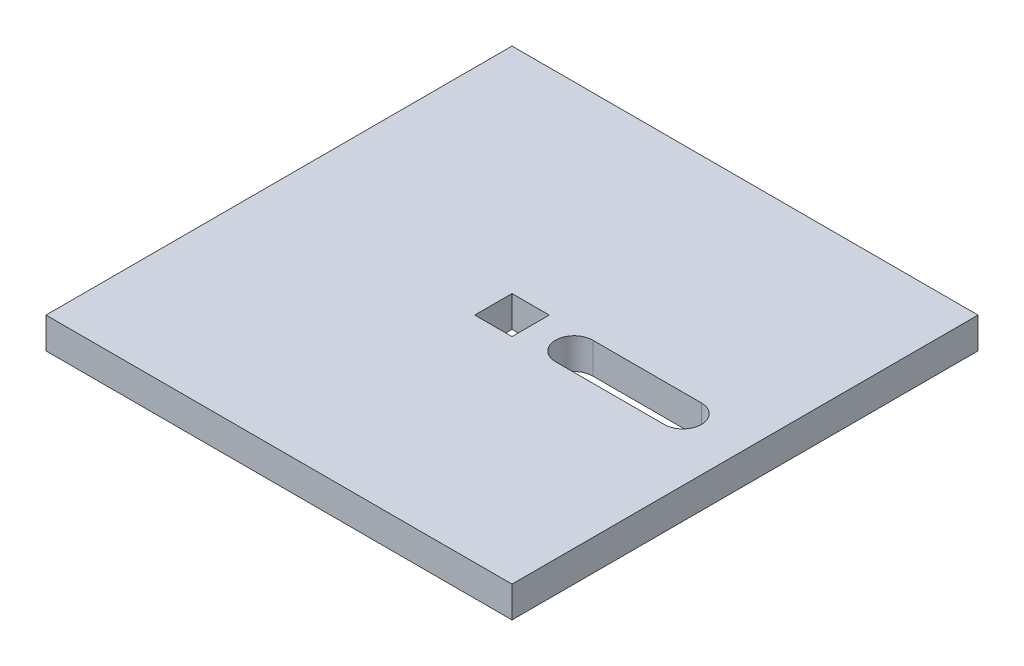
ISO-10303-21;
HEADER;
FILE_DESCRIPTION(('STEP AP214'),'2;1');
FILE_NAME('part.step','',(''),(''),'','','');
FILE_SCHEMA(('AUTOMOTIVE_DESIGN { 1 0 10303 214 1 1 1 1 }'));
ENDSEC;
DATA;
#1=APPLICATION_CONTEXT('core data for automotive mechanical design processes');
#2=APPLICATION_PROTOCOL_DEFINITION('international standard','automotive_design',2000,#1);
#3=PRODUCT_CONTEXT('',#1,'mechanical');
#4=PRODUCT('Part','Part','',(#3));
#5=PRODUCT_RELATED_PRODUCT_CATEGORY('part','',(#4));
#6=PRODUCT_DEFINITION_FORMATION('','',#4);
#7=PRODUCT_DEFINITION_CONTEXT('part definition',#1,'design');
#8=PRODUCT_DEFINITION('design','',#6,#7);
#9=PRODUCT_DEFINITION_SHAPE('','',#8);
#10=(LENGTH_UNIT() NAMED_UNIT(*) SI_UNIT(.MILLI.,.METRE.));
#11=(NAMED_UNIT(*) PLANE_ANGLE_UNIT() SI_UNIT($,.RADIAN.));
#12=(NAMED_UNIT(*) SI_UNIT($,.STERADIAN.) SOLID_ANGLE_UNIT());
#13=UNCERTAINTY_MEASURE_WITH_UNIT(LENGTH_MEASURE(1.E-05),#10,'distance_accuracy_value','');
#14=(GEOMETRIC_REPRESENTATION_CONTEXT(3) GLOBAL_UNCERTAINTY_ASSIGNED_CONTEXT((#13)) GLOBAL_UNIT_ASSIGNED_CONTEXT((#10,
#11,#12)) REPRESENTATION_CONTEXT('',''));
#15=CARTESIAN_POINT('',(0.,0.,0.));
#16=DIRECTION('',(0.,0.,1.));
#17=DIRECTION('',(1.,0.,0.));
#18=AXIS2_PLACEMENT_3D('',#15,#16,#17);
#19=CARTESIAN_POINT('',(75.0000000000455,10.,-75.0000000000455));
#20=DIRECTION('',(-1.,0.,0.));
#21=DIRECTION('',(0.,0.,1.));
#22=AXIS2_PLACEMENT_3D('',#19,#20,#21);
#23=PLANE('',#22);
#24=DIRECTION('',(0.,0.,-1.));
#25=VECTOR('',#24,1.);
#26=CARTESIAN_POINT('',(75.0000000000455,0.,-75.0000000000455));
#27=LINE('',#26,#25);
#28=CARTESIAN_POINT('',(75.0000000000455,0.,75.0000000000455));
#29=VERTEX_POINT('',#28);
#30=CARTESIAN_POINT('',(75.0000000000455,0.,-75.0000000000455));
#31=VERTEX_POINT('',#30);
#32=EDGE_CURVE('E187',#29,#31,#27,.T.);
#33=ORIENTED_EDGE('',*,*,#32,.T.);
#34=DIRECTION('',(0.,-1.,0.));
#35=VECTOR('',#34,1.);
#36=CARTESIAN_POINT('',(75.0000000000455,10.,-75.0000000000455));
#37=LINE('',#36,#35);
#38=CARTESIAN_POINT('',(75.0000000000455,10.,-75.0000000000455));
#39=VERTEX_POINT('',#38);
#40=EDGE_CURVE('E11',#39,#31,#37,.T.);
#41=ORIENTED_EDGE('',*,*,#40,.F.);
#42=DIRECTION('',(0.,0.,-1.));
#43=VECTOR('',#42,1.);
#44=CARTESIAN_POINT('',(75.0000000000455,10.,-75.0000000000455));
#45=LINE('',#44,#43);
#46=CARTESIAN_POINT('',(75.0000000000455,10.,75.0000000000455));
#47=VERTEX_POINT('',#46);
#48=EDGE_CURVE('E197',#47,#39,#45,.T.);
#49=ORIENTED_EDGE('',*,*,#48,.F.);
#50=DIRECTION('',(0.,-1.,0.));
#51=VECTOR('',#50,1.);
#52=CARTESIAN_POINT('',(75.0000000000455,10.,75.0000000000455));
#53=LINE('',#52,#51);
#54=EDGE_CURVE('E206',#47,#29,#53,.T.);
#55=ORIENTED_EDGE('',*,*,#54,.T.);
#56=EDGE_LOOP('',(#33,#41,#49,#55));
#57=FACE_BOUND('',#56,.T.);
#58=ADVANCED_FACE('F39',(#57),#23,.F.);
#59=CARTESIAN_POINT('',(-75.0000000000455,10.,-75.0000000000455));
#60=DIRECTION('',(0.,0.,1.));
#61=DIRECTION('',(1.,0.,0.));
#62=AXIS2_PLACEMENT_3D('',#59,#60,#61);
#63=PLANE('',#62);
#64=DIRECTION('',(-1.,0.,0.));
#65=VECTOR('',#64,1.);
#66=CARTESIAN_POINT('',(-75.0000000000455,0.,-75.0000000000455));
#67=LINE('',#66,#65);
#68=CARTESIAN_POINT('',(-75.0000000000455,0.,-75.0000000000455));
#69=VERTEX_POINT('',#68);
#70=EDGE_CURVE('E207',#31,#69,#67,.T.);
#71=ORIENTED_EDGE('',*,*,#70,.T.);
#72=DIRECTION('',(0.,-1.,0.));
#73=VECTOR('',#72,1.);
#74=CARTESIAN_POINT('',(-75.0000000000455,10.,-75.0000000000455));
#75=LINE('',#74,#73);
#76=CARTESIAN_POINT('',(-75.0000000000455,10.,-75.0000000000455));
#77=VERTEX_POINT('',#76);
#78=EDGE_CURVE('E46',#77,#69,#75,.T.);
#79=ORIENTED_EDGE('',*,*,#78,.F.);
#80=DIRECTION('',(-1.,0.,0.));
#81=VECTOR('',#80,1.);
#82=CARTESIAN_POINT('',(-75.0000000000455,10.,-75.0000000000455));
#83=LINE('',#82,#81);
#84=EDGE_CURVE('E199',#39,#77,#83,.T.);
#85=ORIENTED_EDGE('',*,*,#84,.F.);
#86=ORIENTED_EDGE('',*,*,#40,.T.);
#87=EDGE_LOOP('',(#71,#79,#85,#86));
#88=FACE_BOUND('',#87,.T.);
#89=ADVANCED_FACE('F239',(#88),#63,.F.);
#90=CARTESIAN_POINT('',(-75.0000000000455,10.,-75.0000000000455));
#91=DIRECTION('',(1.,0.,0.));
#92=DIRECTION('',(0.,0.,-1.));
#93=AXIS2_PLACEMENT_3D('',#90,#91,#92);
#94=PLANE('',#93);
#95=DIRECTION('',(0.,0.,1.));
#96=VECTOR('',#95,1.);
#97=CARTESIAN_POINT('',(-75.0000000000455,0.,-75.0000000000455));
#98=LINE('',#97,#96);
#99=CARTESIAN_POINT('',(-75.0000000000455,0.,75.0000000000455));
#100=VERTEX_POINT('',#99);
#101=EDGE_CURVE('E213',#69,#100,#98,.T.);
#102=ORIENTED_EDGE('',*,*,#101,.T.);
#103=DIRECTION('',(0.,-1.,0.));
#104=VECTOR('',#103,1.);
#105=CARTESIAN_POINT('',(-75.0000000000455,10.,75.0000000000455));
#106=LINE('',#105,#104);
#107=CARTESIAN_POINT('',(-75.0000000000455,10.,75.0000000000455));
#108=VERTEX_POINT('',#107);
#109=EDGE_CURVE('E218',#108,#100,#106,.T.);
#110=ORIENTED_EDGE('',*,*,#109,.F.);
#111=DIRECTION('',(0.,0.,1.));
#112=VECTOR('',#111,1.);
#113=CARTESIAN_POINT('',(-75.0000000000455,10.,-75.0000000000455));
#114=LINE('',#113,#112);
#115=EDGE_CURVE('E205',#77,#108,#114,.T.);
#116=ORIENTED_EDGE('',*,*,#115,.F.);
#117=ORIENTED_EDGE('',*,*,#78,.T.);
#118=EDGE_LOOP('',(#102,#110,#116,#117));
#119=FACE_BOUND('',#118,.T.);
#120=ADVANCED_FACE('F223',(#119),#94,.F.);
#121=CARTESIAN_POINT('',(-75.0000000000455,10.,75.0000000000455));
#122=DIRECTION('',(0.,0.,-1.));
#123=DIRECTION('',(-1.,0.,0.));
#124=AXIS2_PLACEMENT_3D('',#121,#122,#123);
#125=PLANE('',#124);
#126=DIRECTION('',(1.,0.,0.));
#127=VECTOR('',#126,1.);
#128=CARTESIAN_POINT('',(-75.0000000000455,0.,75.0000000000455));
#129=LINE('',#128,#127);
#130=EDGE_CURVE('E198',#100,#29,#129,.T.);
#131=ORIENTED_EDGE('',*,*,#130,.T.);
#132=ORIENTED_EDGE('',*,*,#54,.F.);
#133=DIRECTION('',(1.,0.,0.));
#134=VECTOR('',#133,1.);
#135=CARTESIAN_POINT('',(-75.0000000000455,10.,75.0000000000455));
#136=LINE('',#135,#134);
#137=EDGE_CURVE('E204',#108,#47,#136,.T.);
#138=ORIENTED_EDGE('',*,*,#137,.F.);
#139=ORIENTED_EDGE('',*,*,#109,.T.);
#140=EDGE_LOOP('',(#131,#132,#138,#139));
#141=FACE_BOUND('',#140,.T.);
#142=ADVANCED_FACE('F231',(#141),#125,.F.);
#143=CARTESIAN_POINT('',(0.,10.,0.));
#144=DIRECTION('',(0.,1.,0.));
#145=DIRECTION('',(0.,0.,1.));
#146=AXIS2_PLACEMENT_3D('',#143,#144,#145);
#147=PLANE('',#146);
#148=CARTESIAN_POINT('',(20.,10.,0.));
#149=DIRECTION('',(0.,1.,0.));
#150=DIRECTION('',(0.,0.,1.));
#151=AXIS2_PLACEMENT_3D('',#148,#149,#150);
#152=CIRCLE('',#151,6.);
#153=CARTESIAN_POINT('',(20.,10.,-6.));
#154=VERTEX_POINT('',#153);
#155=CARTESIAN_POINT('',(20.,10.,6.));
#156=VERTEX_POINT('',#155);
#157=EDGE_CURVE('E52',#154,#156,#152,.T.);
#158=ORIENTED_EDGE('',*,*,#157,.F.);
#159=DIRECTION('',(-1.,0.,0.));
#160=VECTOR('',#159,1.);
#161=CARTESIAN_POINT('',(20.,10.,-6.));
#162=LINE('',#161,#160);
#163=CARTESIAN_POINT('',(55.,10.,-6.));
#164=VERTEX_POINT('',#163);
#165=EDGE_CURVE('E141',#164,#154,#162,.T.);
#166=ORIENTED_EDGE('',*,*,#165,.F.);
#167=CARTESIAN_POINT('',(55.,10.,0.));
#168=DIRECTION('',(0.,1.,0.));
#169=DIRECTION('',(0.,0.,1.));
#170=AXIS2_PLACEMENT_3D('',#167,#168,#169);
#171=CIRCLE('',#170,6.);
#172=CARTESIAN_POINT('',(55.,10.,6.));
#173=VERTEX_POINT('',#172);
#174=EDGE_CURVE('E148',#173,#164,#171,.T.);
#175=ORIENTED_EDGE('',*,*,#174,.F.);
#176=DIRECTION('',(1.,0.,0.));
#177=VECTOR('',#176,1.);
#178=CARTESIAN_POINT('',(20.,10.,6.));
#179=LINE('',#178,#177);
#180=EDGE_CURVE('E155',#156,#173,#179,.T.);
#181=ORIENTED_EDGE('',*,*,#180,.F.);
#182=EDGE_LOOP('',(#158,#166,#175,#181));
#183=FACE_BOUND('',#182,.T.);
#184=DIRECTION('',(0.,0.,-1.));
#185=VECTOR('',#184,1.);
#186=CARTESIAN_POINT('',(6.,10.,-6.));
#187=LINE('',#186,#185);
#188=CARTESIAN_POINT('',(6.,10.,6.));
#189=VERTEX_POINT('',#188);
#190=CARTESIAN_POINT('',(6.,10.,-6.));
#191=VERTEX_POINT('',#190);
#192=EDGE_CURVE('E157',#189,#191,#187,.T.);
#193=ORIENTED_EDGE('',*,*,#192,.F.);
#194=DIRECTION('',(1.,0.,0.));
#195=VECTOR('',#194,1.);
#196=CARTESIAN_POINT('',(-6.,10.,6.));
#197=LINE('',#196,#195);
#198=CARTESIAN_POINT('',(-6.,10.,6.));
#199=VERTEX_POINT('',#198);
#200=EDGE_CURVE('E168',#199,#189,#197,.T.);
#201=ORIENTED_EDGE('',*,*,#200,.F.);
#202=DIRECTION('',(0.,0.,1.));
#203=VECTOR('',#202,1.);
#204=CARTESIAN_POINT('',(-6.,10.,-6.));
#205=LINE('',#204,#203);
#206=CARTESIAN_POINT('',(-6.,10.,-6.));
#207=VERTEX_POINT('',#206);
#208=EDGE_CURVE('E185',#207,#199,#205,.T.);
#209=ORIENTED_EDGE('',*,*,#208,.F.);
#210=DIRECTION('',(-1.,0.,0.));
#211=VECTOR('',#210,1.);
#212=CARTESIAN_POINT('',(-6.,10.,-6.));
#213=LINE('',#212,#211);
#214=EDGE_CURVE('E176',#191,#207,#213,.T.);
#215=ORIENTED_EDGE('',*,*,#214,.F.);
#216=EDGE_LOOP('',(#193,#201,#209,#215));
#217=FACE_BOUND('',#216,.T.);
#218=ORIENTED_EDGE('',*,*,#48,.T.);
#219=ORIENTED_EDGE('',*,*,#84,.T.);
#220=ORIENTED_EDGE('',*,*,#115,.T.);
#221=ORIENTED_EDGE('',*,*,#137,.T.);
#222=EDGE_LOOP('',(#218,#219,#220,#221));
#223=FACE_BOUND('',#222,.T.);
#224=ADVANCED_FACE('F240',(#183,#217,#223),#147,.T.);
#225=CARTESIAN_POINT('',(0.,0.,0.));
#226=DIRECTION('',(0.,1.,0.));
#227=DIRECTION('',(0.,0.,1.));
#228=AXIS2_PLACEMENT_3D('',#225,#226,#227);
#229=PLANE('',#228);
#230=DIRECTION('',(-1.,0.,0.));
#231=VECTOR('',#230,1.);
#232=CARTESIAN_POINT('',(20.,0.,-6.));
#233=LINE('',#232,#231);
#234=CARTESIAN_POINT('',(55.,0.,-6.));
#235=VERTEX_POINT('',#234);
#236=CARTESIAN_POINT('',(20.,0.,-6.));
#237=VERTEX_POINT('',#236);
#238=EDGE_CURVE('E132',#235,#237,#233,.T.);
#239=ORIENTED_EDGE('',*,*,#238,.T.);
#240=CARTESIAN_POINT('',(20.,0.,0.));
#241=DIRECTION('',(0.,1.,0.));
#242=DIRECTION('',(0.,0.,1.));
#243=AXIS2_PLACEMENT_3D('',#240,#241,#242);
#244=CIRCLE('',#243,6.);
#245=CARTESIAN_POINT('',(20.,0.,6.));
#246=VERTEX_POINT('',#245);
#247=EDGE_CURVE('E127',#237,#246,#244,.T.);
#248=ORIENTED_EDGE('',*,*,#247,.T.);
#249=DIRECTION('',(1.,0.,0.));
#250=VECTOR('',#249,1.);
#251=CARTESIAN_POINT('',(20.,0.,6.));
#252=LINE('',#251,#250);
#253=CARTESIAN_POINT('',(55.,0.,6.));
#254=VERTEX_POINT('',#253);
#255=EDGE_CURVE('E136',#246,#254,#252,.T.);
#256=ORIENTED_EDGE('',*,*,#255,.T.);
#257=CARTESIAN_POINT('',(55.,0.,0.));
#258=DIRECTION('',(0.,1.,0.));
#259=DIRECTION('',(0.,0.,1.));
#260=AXIS2_PLACEMENT_3D('',#257,#258,#259);
#261=CIRCLE('',#260,6.);
#262=EDGE_CURVE('E62',#254,#235,#261,.T.);
#263=ORIENTED_EDGE('',*,*,#262,.T.);
#264=EDGE_LOOP('',(#239,#248,#256,#263));
#265=FACE_BOUND('',#264,.T.);
#266=DIRECTION('',(1.,0.,0.));
#267=VECTOR('',#266,1.);
#268=CARTESIAN_POINT('',(-6.,0.,6.));
#269=LINE('',#268,#267);
#270=CARTESIAN_POINT('',(-6.,0.,6.));
#271=VERTEX_POINT('',#270);
#272=CARTESIAN_POINT('',(6.,0.,6.));
#273=VERTEX_POINT('',#272);
#274=EDGE_CURVE('E173',#271,#273,#269,.T.);
#275=ORIENTED_EDGE('',*,*,#274,.T.);
#276=DIRECTION('',(0.,0.,-1.));
#277=VECTOR('',#276,1.);
#278=CARTESIAN_POINT('',(6.,0.,-6.));
#279=LINE('',#278,#277);
#280=CARTESIAN_POINT('',(6.,0.,-6.));
#281=VERTEX_POINT('',#280);
#282=EDGE_CURVE('E162',#273,#281,#279,.T.);
#283=ORIENTED_EDGE('',*,*,#282,.T.);
#284=DIRECTION('',(-1.,0.,0.));
#285=VECTOR('',#284,1.);
#286=CARTESIAN_POINT('',(-6.,0.,-6.));
#287=LINE('',#286,#285);
#288=CARTESIAN_POINT('',(-6.,0.,-6.));
#289=VERTEX_POINT('',#288);
#290=EDGE_CURVE('E170',#281,#289,#287,.T.);
#291=ORIENTED_EDGE('',*,*,#290,.T.);
#292=DIRECTION('',(0.,0.,1.));
#293=VECTOR('',#292,1.);
#294=CARTESIAN_POINT('',(-6.,0.,-6.));
#295=LINE('',#294,#293);
#296=EDGE_CURVE('E171',#289,#271,#295,.T.);
#297=ORIENTED_EDGE('',*,*,#296,.T.);
#298=EDGE_LOOP('',(#275,#283,#291,#297));
#299=FACE_BOUND('',#298,.T.);
#300=ORIENTED_EDGE('',*,*,#32,.F.);
#301=ORIENTED_EDGE('',*,*,#130,.F.);
#302=ORIENTED_EDGE('',*,*,#101,.F.);
#303=ORIENTED_EDGE('',*,*,#70,.F.);
#304=EDGE_LOOP('',(#300,#301,#302,#303));
#305=FACE_BOUND('',#304,.T.);
#306=ADVANCED_FACE('F145',(#265,#299,#305),#229,.F.);
#307=CARTESIAN_POINT('',(6.,0.,-6.));
#308=DIRECTION('',(1.,0.,0.));
#309=DIRECTION('',(0.,0.,-1.));
#310=AXIS2_PLACEMENT_3D('',#307,#308,#309);
#311=PLANE('',#310);
#312=ORIENTED_EDGE('',*,*,#192,.T.);
#313=DIRECTION('',(0.,1.,0.));
#314=VECTOR('',#313,1.);
#315=CARTESIAN_POINT('',(6.,0.,-6.));
#316=LINE('',#315,#314);
#317=EDGE_CURVE('E180',#281,#191,#316,.T.);
#318=ORIENTED_EDGE('',*,*,#317,.F.);
#319=ORIENTED_EDGE('',*,*,#282,.F.);
#320=DIRECTION('',(0.,1.,0.));
#321=VECTOR('',#320,1.);
#322=CARTESIAN_POINT('',(6.,0.,6.));
#323=LINE('',#322,#321);
#324=EDGE_CURVE('E190',#273,#189,#323,.T.);
#325=ORIENTED_EDGE('',*,*,#324,.T.);
#326=EDGE_LOOP('',(#312,#318,#319,#325));
#327=FACE_BOUND('',#326,.T.);
#328=ADVANCED_FACE('F249',(#327),#311,.F.);
#329=CARTESIAN_POINT('',(-6.,0.,6.));
#330=DIRECTION('',(0.,0.,1.));
#331=DIRECTION('',(1.,0.,0.));
#332=AXIS2_PLACEMENT_3D('',#329,#330,#331);
#333=PLANE('',#332);
#334=ORIENTED_EDGE('',*,*,#200,.T.);
#335=ORIENTED_EDGE('',*,*,#324,.F.);
#336=ORIENTED_EDGE('',*,*,#274,.F.);
#337=DIRECTION('',(0.,1.,0.));
#338=VECTOR('',#337,1.);
#339=CARTESIAN_POINT('',(-6.,0.,6.));
#340=LINE('',#339,#338);
#341=EDGE_CURVE('E189',#271,#199,#340,.T.);
#342=ORIENTED_EDGE('',*,*,#341,.T.);
#343=EDGE_LOOP('',(#334,#335,#336,#342));
#344=FACE_BOUND('',#343,.T.);
#345=ADVANCED_FACE('F257',(#344),#333,.F.);
#346=CARTESIAN_POINT('',(-6.,0.,-6.));
#347=DIRECTION('',(-1.,0.,0.));
#348=DIRECTION('',(0.,0.,1.));
#349=AXIS2_PLACEMENT_3D('',#346,#347,#348);
#350=PLANE('',#349);
#351=ORIENTED_EDGE('',*,*,#208,.T.);
#352=ORIENTED_EDGE('',*,*,#341,.F.);
#353=ORIENTED_EDGE('',*,*,#296,.F.);
#354=DIRECTION('',(0.,1.,0.));
#355=VECTOR('',#354,1.);
#356=CARTESIAN_POINT('',(-6.,0.,-6.));
#357=LINE('',#356,#355);
#358=EDGE_CURVE('E191',#289,#207,#357,.T.);
#359=ORIENTED_EDGE('',*,*,#358,.T.);
#360=EDGE_LOOP('',(#351,#352,#353,#359));
#361=FACE_BOUND('',#360,.T.);
#362=ADVANCED_FACE('F262',(#361),#350,.F.);
#363=CARTESIAN_POINT('',(-6.,0.,-6.));
#364=DIRECTION('',(0.,0.,-1.));
#365=DIRECTION('',(-1.,0.,0.));
#366=AXIS2_PLACEMENT_3D('',#363,#364,#365);
#367=PLANE('',#366);
#368=ORIENTED_EDGE('',*,*,#214,.T.);
#369=ORIENTED_EDGE('',*,*,#358,.F.);
#370=ORIENTED_EDGE('',*,*,#290,.F.);
#371=ORIENTED_EDGE('',*,*,#317,.T.);
#372=EDGE_LOOP('',(#368,#369,#370,#371));
#373=FACE_BOUND('',#372,.T.);
#374=ADVANCED_FACE('F256',(#373),#367,.F.);
#375=CARTESIAN_POINT('',(20.,0.,0.));
#376=DIRECTION('',(0.,1.,0.));
#377=DIRECTION('',(0.,0.,1.));
#378=AXIS2_PLACEMENT_3D('',#375,#376,#377);
#379=CYLINDRICAL_SURFACE('',#378,6.);
#380=ORIENTED_EDGE('',*,*,#157,.T.);
#381=DIRECTION('',(0.,1.,0.));
#382=VECTOR('',#381,1.);
#383=CARTESIAN_POINT('',(20.,0.,6.));
#384=LINE('',#383,#382);
#385=EDGE_CURVE('E123',#246,#156,#384,.T.);
#386=ORIENTED_EDGE('',*,*,#385,.F.);
#387=ORIENTED_EDGE('',*,*,#247,.F.);
#388=DIRECTION('',(0.,1.,0.));
#389=VECTOR('',#388,1.);
#390=CARTESIAN_POINT('',(20.,0.,-6.));
#391=LINE('',#390,#389);
#392=EDGE_CURVE('E156',#237,#154,#391,.T.);
#393=ORIENTED_EDGE('',*,*,#392,.T.);
#394=EDGE_LOOP('',(#380,#386,#387,#393));
#395=FACE_BOUND('',#394,.T.);
#396=ADVANCED_FACE('F130',(#395),#379,.F.);
#397=CARTESIAN_POINT('',(20.,0.,-6.));
#398=DIRECTION('',(0.,0.,-1.));
#399=DIRECTION('',(-1.,0.,0.));
#400=AXIS2_PLACEMENT_3D('',#397,#398,#399);
#401=PLANE('',#400);
#402=ORIENTED_EDGE('',*,*,#165,.T.);
#403=ORIENTED_EDGE('',*,*,#392,.F.);
#404=ORIENTED_EDGE('',*,*,#238,.F.);
#405=DIRECTION('',(0.,1.,0.));
#406=VECTOR('',#405,1.);
#407=CARTESIAN_POINT('',(55.,0.,-6.));
#408=LINE('',#407,#406);
#409=EDGE_CURVE('E161',#235,#164,#408,.T.);
#410=ORIENTED_EDGE('',*,*,#409,.T.);
#411=EDGE_LOOP('',(#402,#403,#404,#410));
#412=FACE_BOUND('',#411,.T.);
#413=ADVANCED_FACE('F273',(#412),#401,.F.);
#414=CARTESIAN_POINT('',(55.,0.,0.));
#415=DIRECTION('',(0.,1.,0.));
#416=DIRECTION('',(0.,0.,1.));
#417=AXIS2_PLACEMENT_3D('',#414,#415,#416);
#418=CYLINDRICAL_SURFACE('',#417,6.);
#419=ORIENTED_EDGE('',*,*,#174,.T.);
#420=ORIENTED_EDGE('',*,*,#409,.F.);
#421=ORIENTED_EDGE('',*,*,#262,.F.);
#422=DIRECTION('',(0.,1.,0.));
#423=VECTOR('',#422,1.);
#424=CARTESIAN_POINT('',(55.,0.,6.));
#425=LINE('',#424,#423);
#426=EDGE_CURVE('E133',#254,#173,#425,.T.);
#427=ORIENTED_EDGE('',*,*,#426,.T.);
#428=EDGE_LOOP('',(#419,#420,#421,#427));
#429=FACE_BOUND('',#428,.T.);
#430=ADVANCED_FACE('F275',(#429),#418,.F.);
#431=CARTESIAN_POINT('',(20.,0.,6.));
#432=DIRECTION('',(0.,0.,1.));
#433=DIRECTION('',(1.,0.,0.));
#434=AXIS2_PLACEMENT_3D('',#431,#432,#433);
#435=PLANE('',#434);
#436=ORIENTED_EDGE('',*,*,#180,.T.);
#437=ORIENTED_EDGE('',*,*,#426,.F.);
#438=ORIENTED_EDGE('',*,*,#255,.F.);
#439=ORIENTED_EDGE('',*,*,#385,.T.);
#440=EDGE_LOOP('',(#436,#437,#438,#439));
#441=FACE_BOUND('',#440,.T.);
#442=ADVANCED_FACE('F139',(#441),#435,.F.);
#443=CLOSED_SHELL('',(#58,#89,#120,#142,#224,#306,#328,#345,#362,#374,#396,#413,#430,#442));
#444=MANIFOLD_SOLID_BREP('B2',#443);
#445=ADVANCED_BREP_SHAPE_REPRESENTATION('',(#18,#444),#14);
#446=SHAPE_DEFINITION_REPRESENTATION(#9,#445);
ENDSEC;
END-ISO-10303-21;
